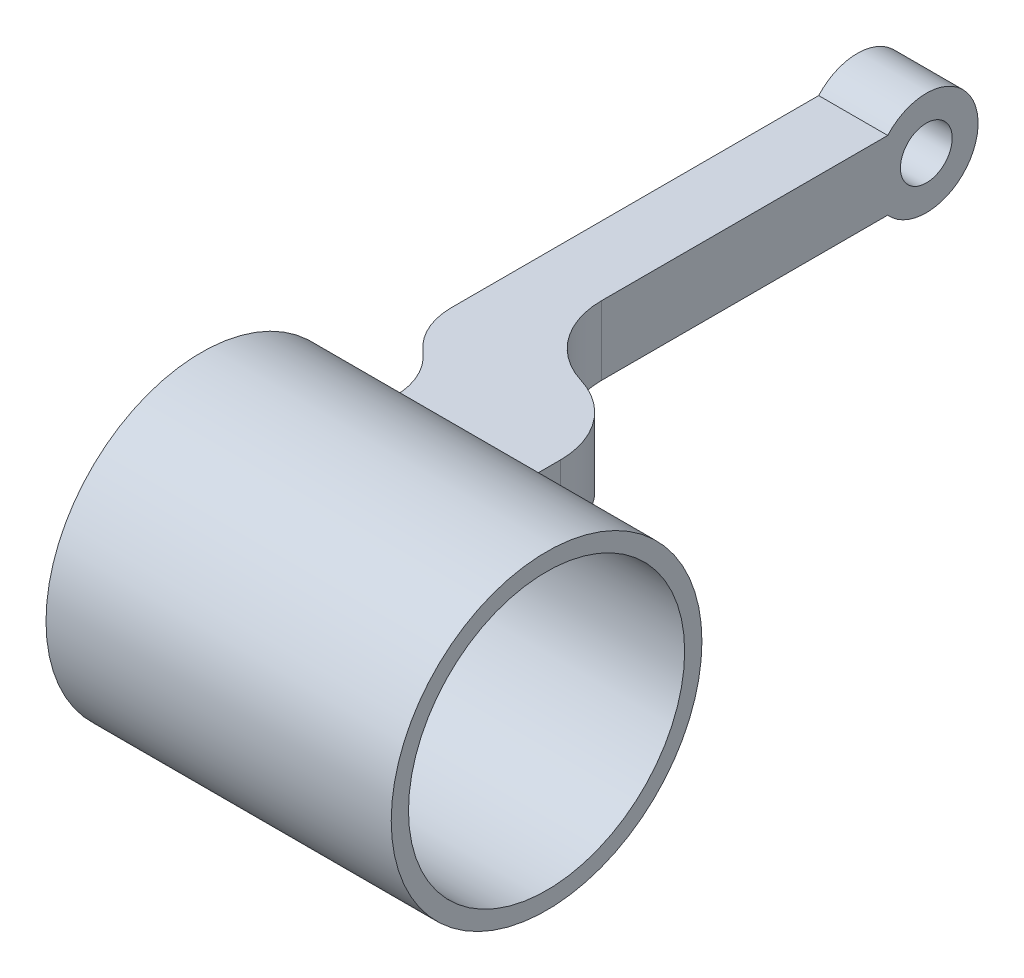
from build123d import *

# Parameters (mm, degrees)
SKETCH1_R           = 28.575
SKETCH1_R_2         = 25.4
EXTRUDE_THIN1_DEPTH = 63.5
EXTRUDE1_DEPTH      = 6.35
SKETCH3_R           = 9.525
EXTRUDE2_DEPTH      = 6.35
EXTRUDE3_DEPTH      = 154.257483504
EXTRUDE3_DEPTH_BACK = 154.257483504
SKETCH4_R           = 4.7625


with BuildPart() as part:
    # Sketch1 → Extrude-Thin1 (new body)
    with BuildSketch(Plane(origin=(0, 0, 0), x_dir=(0, 0, -1), z_dir=(1, 0, 0))):
        Circle(SKETCH1_R)
        Circle(SKETCH1_R_2, mode=Mode.SUBTRACT)
    extrude(amount=EXTRUDE_THIN1_DEPTH)

    # Sketch2 → Extrude1 (add, symmetric)
    with BuildSketch(Plane(origin=(0, 0, 0), x_dir=(1, 0, 0), z_dir=(0, 1, 0))):
        with BuildLine():
            Line((2.54, 25.4), (2.54, 33.02))
            ThreePointArc((2.54, 33.02), (1.375347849, 38.332791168), (-1.905, 42.671164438))
            ThreePointArc((-1.905, 42.671164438), (-5.185347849, 47.009537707), (-6.35, 52.322328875))
            Line((-6.35, 52.322328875), (-6.35, 127))
            Line((-6.35, 127), (6.35, 127))
            Line((6.35, 127), (6.35, 67.254730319))
            ThreePointArc((6.35, 67.254730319), (9.342563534, 58.185116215), (17.145, 52.67736516))
            ThreePointArc((17.145, 52.67736516), (24.947436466, 47.169614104), (27.94, 38.1))
            Line((27.94, 38.1), (27.94, 25.4))
            Line((27.94, 25.4), (2.54, 25.4))
        make_face()
    extrude(amount=EXTRUDE1_DEPTH, both=True)

    # Sketch3 → Extrude2 (add, symmetric)
    with BuildSketch(Plane(origin=(0, 0, 0), x_dir=(0, 0, -1), z_dir=(1, 0, 0))):
        with Locations((127, 0)):
            Circle(SKETCH3_R)
    extrude(amount=EXTRUDE2_DEPTH, both=True)

    # Sketch4 → Extrude3 (cut, two sides: drawn at the far end of the back side and taken through both)
    with BuildSketch(Plane(origin=(0, 0, 0), x_dir=(0, 0, -1), z_dir=(1, 0, 0)).offset(-EXTRUDE3_DEPTH_BACK)):
        with Locations((127, 0)):
            Circle(SKETCH4_R)
    extrude(amount=EXTRUDE3_DEPTH + EXTRUDE3_DEPTH_BACK, mode=Mode.SUBTRACT)


solid = part.part
